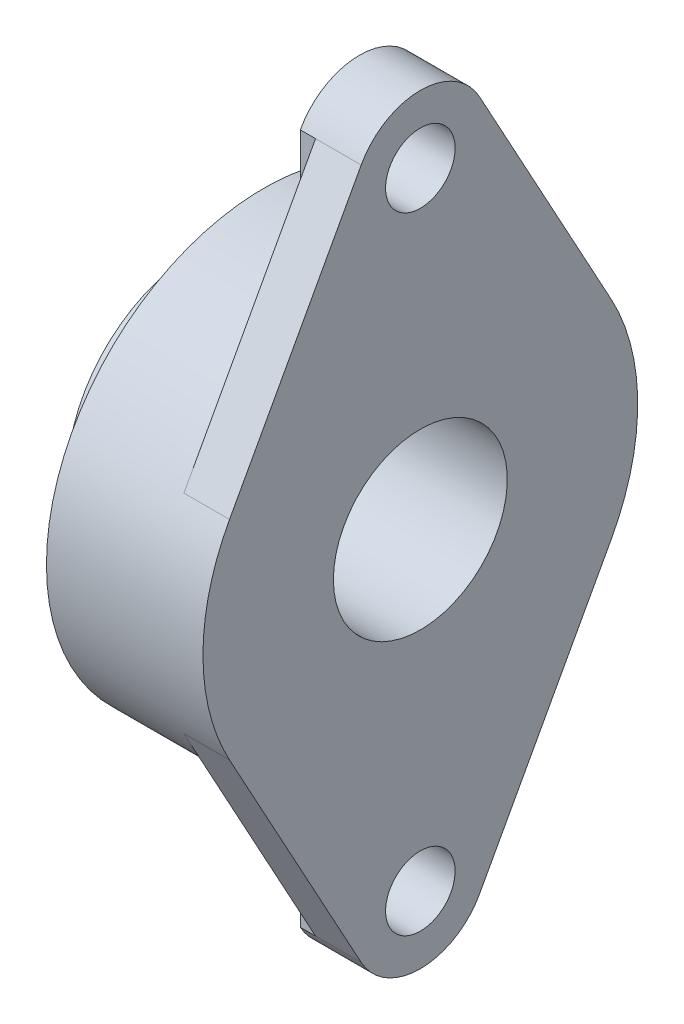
ISO-10303-21;
HEADER;
FILE_DESCRIPTION(('STEP AP214'),'2;1');
FILE_NAME('part.step','',(''),(''),'','','');
FILE_SCHEMA(('AUTOMOTIVE_DESIGN { 1 0 10303 214 1 1 1 1 }'));
ENDSEC;
DATA;
#1=APPLICATION_CONTEXT('core data for automotive mechanical design processes');
#2=APPLICATION_PROTOCOL_DEFINITION('international standard','automotive_design',2000,#1);
#3=PRODUCT_CONTEXT('',#1,'mechanical');
#4=PRODUCT('Part','Part','',(#3));
#5=PRODUCT_RELATED_PRODUCT_CATEGORY('part','',(#4));
#6=PRODUCT_DEFINITION_FORMATION('','',#4);
#7=PRODUCT_DEFINITION_CONTEXT('part definition',#1,'design');
#8=PRODUCT_DEFINITION('design','',#6,#7);
#9=PRODUCT_DEFINITION_SHAPE('','',#8);
#10=(LENGTH_UNIT() NAMED_UNIT(*) SI_UNIT(.MILLI.,.METRE.));
#11=(NAMED_UNIT(*) PLANE_ANGLE_UNIT() SI_UNIT($,.RADIAN.));
#12=(NAMED_UNIT(*) SI_UNIT($,.STERADIAN.) SOLID_ANGLE_UNIT());
#13=UNCERTAINTY_MEASURE_WITH_UNIT(LENGTH_MEASURE(1.E-05),#10,'distance_accuracy_value','');
#14=(GEOMETRIC_REPRESENTATION_CONTEXT(3) GLOBAL_UNCERTAINTY_ASSIGNED_CONTEXT((#13)) GLOBAL_UNIT_ASSIGNED_CONTEXT((#10,
#11,#12)) REPRESENTATION_CONTEXT('',''));
#15=CARTESIAN_POINT('',(0.,0.,0.));
#16=DIRECTION('',(0.,0.,1.));
#17=DIRECTION('',(1.,0.,0.));
#18=AXIS2_PLACEMENT_3D('',#15,#16,#17);
#19=CARTESIAN_POINT('',(-10.5,-79.759870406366,-43.8861967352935));
#20=DIRECTION('',(-1.,0.,0.));
#21=DIRECTION('',(0.,0.,1.));
#22=AXIS2_PLACEMENT_3D('',#19,#20,#21);
#23=PLANE('',#22);
#24=DIRECTION('',(0.,-1.,0.));
#25=VECTOR('',#24,1.);
#26=CARTESIAN_POINT('',(-10.5,-63.7703056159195,-13.604720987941));
#27=LINE('',#26,#25);
#28=CARTESIAN_POINT('',(-10.5,-48.1135278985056,-13.604720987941));
#29=VERTEX_POINT('',#28);
#30=CARTESIAN_POINT('',(-10.5,-79.4270833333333,-13.604720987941));
#31=VERTEX_POINT('',#30);
#32=EDGE_CURVE('E71',#29,#31,#27,.T.);
#33=ORIENTED_EDGE('',*,*,#32,.F.);
#34=CARTESIAN_POINT('',(-10.5,0.,0.));
#35=DIRECTION('',(-1.,0.,0.));
#36=DIRECTION('',(0.,0.,1.));
#37=AXIS2_PLACEMENT_3D('',#34,#35,#36);
#38=CIRCLE('',#37,50.);
#39=CARTESIAN_POINT('',(-10.5,-23.962571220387,-43.8838830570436));
#40=VERTEX_POINT('',#39);
#41=EDGE_CURVE('E208',#40,#29,#38,.T.);
#42=ORIENTED_EDGE('',*,*,#41,.F.);
#43=DIRECTION('',(0.,0.877723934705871,-0.479166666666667));
#44=VECTOR('',#43,1.);
#45=CARTESIAN_POINT('',(-10.5,-51.6927083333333,-28.7454588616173));
#46=LINE('',#45,#44);
#47=EDGE_CURVE('E308',#31,#40,#46,.T.);
#48=ORIENTED_EDGE('',*,*,#47,.F.);
#49=EDGE_LOOP('',(#33,#42,#48));
#50=FACE_BOUND('',#49,.T.);
#51=ADVANCED_FACE('F16',(#50),#23,.T.);
#52=CARTESIAN_POINT('',(-14.,-79.4270833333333,-13.604720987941));
#53=DIRECTION('',(0.,0.,-1.));
#54=DIRECTION('',(0.,1.,0.));
#55=AXIS2_PLACEMENT_3D('',#52,#53,#54);
#56=PLANE('',#55);
#57=DIRECTION('',(0.,-1.,0.));
#58=VECTOR('',#57,1.);
#59=CARTESIAN_POINT('',(-14.,-68.0036963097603,-13.604720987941));
#60=LINE('',#59,#58);
#61=CARTESIAN_POINT('',(-14.,-48.1135278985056,-13.604720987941));
#62=VERTEX_POINT('',#61);
#63=CARTESIAN_POINT('',(-14.,-79.4270833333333,-13.604720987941));
#64=VERTEX_POINT('',#63);
#65=EDGE_CURVE('E65',#62,#64,#60,.T.);
#66=ORIENTED_EDGE('',*,*,#65,.F.);
#67=DIRECTION('',(-1.,0.,0.));
#68=VECTOR('',#67,1.);
#69=CARTESIAN_POINT('',(-18.,-48.1135278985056,-13.604720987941));
#70=LINE('',#69,#68);
#71=EDGE_CURVE('E300',#29,#62,#70,.T.);
#72=ORIENTED_EDGE('',*,*,#71,.F.);
#73=ORIENTED_EDGE('',*,*,#32,.T.);
#74=DIRECTION('',(1.,0.,0.));
#75=VECTOR('',#74,1.);
#76=CARTESIAN_POINT('',(-7.,-79.4270833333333,-13.604720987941));
#77=LINE('',#76,#75);
#78=EDGE_CURVE('E316',#64,#31,#77,.T.);
#79=ORIENTED_EDGE('',*,*,#78,.F.);
#80=EDGE_LOOP('',(#66,#72,#73,#79));
#81=FACE_BOUND('',#80,.T.);
#82=ADVANCED_FACE('F482',(#81),#56,.T.);
#83=CARTESIAN_POINT('',(-10.5,23.6297840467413,-43.8861967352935));
#84=DIRECTION('',(-1.,0.,0.));
#85=DIRECTION('',(0.,0.,1.));
#86=AXIS2_PLACEMENT_3D('',#83,#84,#85);
#87=PLANE('',#86);
#88=CARTESIAN_POINT('',(-10.5,0.,0.));
#89=DIRECTION('',(-1.,0.,0.));
#90=DIRECTION('',(0.,0.,1.));
#91=AXIS2_PLACEMENT_3D('',#88,#89,#90);
#92=CIRCLE('',#91,50.);
#93=CARTESIAN_POINT('',(-10.5,48.1135278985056,-13.604720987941));
#94=VERTEX_POINT('',#93);
#95=CARTESIAN_POINT('',(-10.5,23.9625711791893,-43.8838830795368));
#96=VERTEX_POINT('',#95);
#97=EDGE_CURVE('E360',#94,#96,#92,.T.);
#98=ORIENTED_EDGE('',*,*,#97,.F.);
#99=DIRECTION('',(0.,-1.,0.));
#100=VECTOR('',#99,1.);
#101=CARTESIAN_POINT('',(-10.5,63.7703056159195,-13.604720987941));
#102=LINE('',#101,#100);
#103=CARTESIAN_POINT('',(-10.5,79.4270833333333,-13.604720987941));
#104=VERTEX_POINT('',#103);
#105=EDGE_CURVE('E270',#104,#94,#102,.T.);
#106=ORIENTED_EDGE('',*,*,#105,.F.);
#107=DIRECTION('',(0.,0.87772393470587,0.479166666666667));
#108=VECTOR('',#107,1.);
#109=CARTESIAN_POINT('',(-10.5,51.6927083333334,-28.7454588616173));
#110=LINE('',#109,#108);
#111=EDGE_CURVE('E203',#96,#104,#110,.T.);
#112=ORIENTED_EDGE('',*,*,#111,.F.);
#113=EDGE_LOOP('',(#98,#106,#112));
#114=FACE_BOUND('',#113,.T.);
#115=ADVANCED_FACE('F371',(#114),#87,.T.);
#116=CARTESIAN_POINT('',(-14.,48.1135278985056,-13.604720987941));
#117=DIRECTION('',(0.,0.,-1.));
#118=DIRECTION('',(0.,1.,0.));
#119=AXIS2_PLACEMENT_3D('',#116,#117,#118);
#120=PLANE('',#119);
#121=DIRECTION('',(0.,-1.,0.));
#122=VECTOR('',#121,1.);
#123=CARTESIAN_POINT('',(-14.,68.0036963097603,-13.604720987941));
#124=LINE('',#123,#122);
#125=CARTESIAN_POINT('',(-14.,79.4270833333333,-13.604720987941));
#126=VERTEX_POINT('',#125);
#127=CARTESIAN_POINT('',(-14.,48.1135278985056,-13.604720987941));
#128=VERTEX_POINT('',#127);
#129=EDGE_CURVE('E245',#126,#128,#124,.T.);
#130=ORIENTED_EDGE('',*,*,#129,.F.);
#131=DIRECTION('',(-1.,0.,0.));
#132=VECTOR('',#131,1.);
#133=CARTESIAN_POINT('',(-7.,79.4270833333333,-13.604720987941));
#134=LINE('',#133,#132);
#135=EDGE_CURVE('E197',#104,#126,#134,.T.);
#136=ORIENTED_EDGE('',*,*,#135,.F.);
#137=ORIENTED_EDGE('',*,*,#105,.T.);
#138=DIRECTION('',(1.,0.,0.));
#139=VECTOR('',#138,1.);
#140=CARTESIAN_POINT('',(-18.,48.1135278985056,-13.604720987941));
#141=LINE('',#140,#139);
#142=EDGE_CURVE('E215',#128,#94,#141,.T.);
#143=ORIENTED_EDGE('',*,*,#142,.F.);
#144=EDGE_LOOP('',(#130,#136,#137,#143));
#145=FACE_BOUND('',#144,.T.);
#146=ADVANCED_FACE('F366',(#145),#120,.T.);
#147=CARTESIAN_POINT('',(-14.,-48.1135278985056,13.604720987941));
#148=DIRECTION('',(0.,0.,1.));
#149=DIRECTION('',(0.,-1.,0.));
#150=AXIS2_PLACEMENT_3D('',#147,#148,#149);
#151=PLANE('',#150);
#152=DIRECTION('',(0.,1.,0.));
#153=VECTOR('',#152,1.);
#154=CARTESIAN_POINT('',(-14.,-68.0036963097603,13.604720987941));
#155=LINE('',#154,#153);
#156=CARTESIAN_POINT('',(-14.,-79.4270833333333,13.604720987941));
#157=VERTEX_POINT('',#156);
#158=CARTESIAN_POINT('',(-14.,-48.1135278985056,13.604720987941));
#159=VERTEX_POINT('',#158);
#160=EDGE_CURVE('E59',#157,#159,#155,.T.);
#161=ORIENTED_EDGE('',*,*,#160,.F.);
#162=DIRECTION('',(-1.,0.,0.));
#163=VECTOR('',#162,1.);
#164=CARTESIAN_POINT('',(-7.,-79.4270833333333,13.604720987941));
#165=LINE('',#164,#163);
#166=CARTESIAN_POINT('',(-10.5,-79.4270833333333,13.604720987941));
#167=VERTEX_POINT('',#166);
#168=EDGE_CURVE('E257',#167,#157,#165,.T.);
#169=ORIENTED_EDGE('',*,*,#168,.F.);
#170=DIRECTION('',(0.,1.,0.));
#171=VECTOR('',#170,1.);
#172=CARTESIAN_POINT('',(-10.5,-79.4270833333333,13.604720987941));
#173=LINE('',#172,#171);
#174=CARTESIAN_POINT('',(-10.5,-48.1135278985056,13.604720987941));
#175=VERTEX_POINT('',#174);
#176=EDGE_CURVE('E251',#175,#167,#173,.F.);
#177=ORIENTED_EDGE('',*,*,#176,.F.);
#178=DIRECTION('',(1.,0.,0.));
#179=VECTOR('',#178,1.);
#180=CARTESIAN_POINT('',(-18.,-48.1135278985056,13.604720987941));
#181=LINE('',#180,#179);
#182=EDGE_CURVE('E277',#159,#175,#181,.T.);
#183=ORIENTED_EDGE('',*,*,#182,.F.);
#184=EDGE_LOOP('',(#161,#169,#177,#183));
#185=FACE_BOUND('',#184,.T.);
#186=ADVANCED_FACE('F432',(#185),#151,.T.);
#187=CARTESIAN_POINT('',(-10.5,23.6297840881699,13.604720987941));
#188=DIRECTION('',(-1.,0.,0.));
#189=DIRECTION('',(0.,0.,1.));
#190=AXIS2_PLACEMENT_3D('',#187,#188,#189);
#191=PLANE('',#190);
#192=DIRECTION('',(0.,1.,0.));
#193=VECTOR('',#192,1.);
#194=CARTESIAN_POINT('',(-10.5,63.7703056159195,13.604720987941));
#195=LINE('',#194,#193);
#196=CARTESIAN_POINT('',(-10.5,48.1135278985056,13.604720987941));
#197=VERTEX_POINT('',#196);
#198=CARTESIAN_POINT('',(-10.5,79.4270833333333,13.604720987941));
#199=VERTEX_POINT('',#198);
#200=EDGE_CURVE('E133',#197,#199,#195,.T.);
#201=ORIENTED_EDGE('',*,*,#200,.F.);
#202=CARTESIAN_POINT('',(-10.5,0.,0.));
#203=DIRECTION('',(-1.,0.,0.));
#204=DIRECTION('',(0.,0.,1.));
#205=AXIS2_PLACEMENT_3D('',#202,#203,#204);
#206=CIRCLE('',#205,50.);
#207=CARTESIAN_POINT('',(-10.5,23.9625712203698,43.883883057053));
#208=VERTEX_POINT('',#207);
#209=EDGE_CURVE('E184',#208,#197,#206,.T.);
#210=ORIENTED_EDGE('',*,*,#209,.F.);
#211=DIRECTION('',(0.,-0.877723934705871,0.479166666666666));
#212=VECTOR('',#211,1.);
#213=CARTESIAN_POINT('',(-10.5,51.6927083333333,28.7454588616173));
#214=LINE('',#213,#212);
#215=EDGE_CURVE('E274',#199,#208,#214,.T.);
#216=ORIENTED_EDGE('',*,*,#215,.F.);
#217=EDGE_LOOP('',(#201,#210,#216));
#218=FACE_BOUND('',#217,.T.);
#219=ADVANCED_FACE('F420',(#218),#191,.T.);
#220=CARTESIAN_POINT('',(-14.,79.4270833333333,13.604720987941));
#221=DIRECTION('',(0.,0.,1.));
#222=DIRECTION('',(0.,-1.,0.));
#223=AXIS2_PLACEMENT_3D('',#220,#221,#222);
#224=PLANE('',#223);
#225=DIRECTION('',(0.,1.,0.));
#226=VECTOR('',#225,1.);
#227=CARTESIAN_POINT('',(-14.,68.0036963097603,13.604720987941));
#228=LINE('',#227,#226);
#229=CARTESIAN_POINT('',(-14.,48.1135278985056,13.604720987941));
#230=VERTEX_POINT('',#229);
#231=CARTESIAN_POINT('',(-14.,79.4270833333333,13.604720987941));
#232=VERTEX_POINT('',#231);
#233=EDGE_CURVE('E128',#230,#232,#228,.T.);
#234=ORIENTED_EDGE('',*,*,#233,.F.);
#235=DIRECTION('',(-1.,0.,0.));
#236=VECTOR('',#235,1.);
#237=CARTESIAN_POINT('',(-18.,48.1135278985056,13.604720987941));
#238=LINE('',#237,#236);
#239=EDGE_CURVE('E267',#197,#230,#238,.T.);
#240=ORIENTED_EDGE('',*,*,#239,.F.);
#241=ORIENTED_EDGE('',*,*,#200,.T.);
#242=DIRECTION('',(1.,0.,0.));
#243=VECTOR('',#242,1.);
#244=CARTESIAN_POINT('',(-7.,79.4270833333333,13.604720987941));
#245=LINE('',#244,#243);
#246=EDGE_CURVE('E284',#232,#199,#245,.T.);
#247=ORIENTED_EDGE('',*,*,#246,.F.);
#248=EDGE_LOOP('',(#234,#240,#241,#247));
#249=FACE_BOUND('',#248,.T.);
#250=ADVANCED_FACE('F424',(#249),#224,.T.);
#251=CARTESIAN_POINT('',(-10.5,-79.7598704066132,13.604720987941));
#252=DIRECTION('',(-1.,0.,0.));
#253=DIRECTION('',(0.,0.,1.));
#254=AXIS2_PLACEMENT_3D('',#251,#252,#253);
#255=PLANE('',#254);
#256=CARTESIAN_POINT('',(-10.5,0.,0.));
#257=DIRECTION('',(-1.,0.,0.));
#258=DIRECTION('',(0.,0.,1.));
#259=AXIS2_PLACEMENT_3D('',#256,#257,#258);
#260=CIRCLE('',#259,50.);
#261=CARTESIAN_POINT('',(-10.5,-23.9625711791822,43.8838830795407));
#262=VERTEX_POINT('',#261);
#263=EDGE_CURVE('E154',#175,#262,#260,.T.);
#264=ORIENTED_EDGE('',*,*,#263,.F.);
#265=ORIENTED_EDGE('',*,*,#176,.T.);
#266=DIRECTION('',(0.,-0.877723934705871,-0.479166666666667));
#267=VECTOR('',#266,1.);
#268=CARTESIAN_POINT('',(-10.5,-51.6927083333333,28.7454588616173));
#269=LINE('',#268,#267);
#270=EDGE_CURVE('E171',#262,#167,#269,.T.);
#271=ORIENTED_EDGE('',*,*,#270,.F.);
#272=EDGE_LOOP('',(#264,#265,#271));
#273=FACE_BOUND('',#272,.T.);
#274=ADVANCED_FACE('F238',(#273),#255,.T.);
#275=CARTESIAN_POINT('',(-14.,48.1135278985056,13.604720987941));
#276=CARTESIAN_POINT('',(-14.,87.5,13.604720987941));
#277=CARTESIAN_POINT('',(-14.,87.893864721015,13.604720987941));
#278=B_SPLINE_CURVE_WITH_KNOTS('',1,(#275,#276,#277),.UNSPECIFIED.,.F.,.F.,(2,1,2),(0.,1.,1.01),.UNSPECIFIED.);
#279=DIRECTION('',(0.,0.,-1.));
#280=VECTOR('',#279,1.);
#281=SURFACE_OF_LINEAR_EXTRUSION('',#278,#280);
#282=CARTESIAN_POINT('',(-14.,72.,0.));
#283=DIRECTION('',(1.,0.,0.));
#284=DIRECTION('',(0.,0.,-1.));
#285=AXIS2_PLACEMENT_3D('',#282,#283,#284);
#286=CIRCLE('',#285,7.99999999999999);
#287=CARTESIAN_POINT('',(-14.,72.,-7.99999999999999));
#288=VERTEX_POINT('',#287);
#289=EDGE_CURVE('E165',#288,#288,#286,.F.);
#290=ORIENTED_EDGE('',*,*,#289,.F.);
#291=EDGE_LOOP('',(#290));
#292=FACE_BOUND('',#291,.T.);
#293=ORIENTED_EDGE('',*,*,#129,.T.);
#294=CARTESIAN_POINT('',(-14.,0.,0.));
#295=DIRECTION('',(-1.,0.,0.));
#296=DIRECTION('',(0.,0.,1.));
#297=AXIS2_PLACEMENT_3D('',#294,#295,#296);
#298=CIRCLE('',#297,50.);
#299=EDGE_CURVE('E261',#230,#128,#298,.T.);
#300=ORIENTED_EDGE('',*,*,#299,.F.);
#301=ORIENTED_EDGE('',*,*,#233,.T.);
#302=CARTESIAN_POINT('',(-14.,72.,0.));
#303=DIRECTION('',(1.,0.,0.));
#304=DIRECTION('',(0.,0.,-1.));
#305=AXIS2_PLACEMENT_3D('',#302,#303,#304);
#306=CIRCLE('',#305,15.5);
#307=EDGE_CURVE('E288',#126,#232,#306,.T.);
#308=ORIENTED_EDGE('',*,*,#307,.F.);
#309=EDGE_LOOP('',(#293,#300,#301,#308));
#310=FACE_BOUND('',#309,.T.);
#311=ADVANCED_FACE('F232',(#292,#310),#281,.T.);
#312=CARTESIAN_POINT('',(-14.,-87.893864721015,13.604720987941));
#313=CARTESIAN_POINT('',(-14.,-87.5,13.604720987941));
#314=CARTESIAN_POINT('',(-14.,-48.1135278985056,13.604720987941));
#315=B_SPLINE_CURVE_WITH_KNOTS('',1,(#312,#313,#314),.UNSPECIFIED.,.F.,.F.,(2,1,2),(-0.01,0.,
1.),.UNSPECIFIED.);
#316=DIRECTION('',(0.,0.,-1.));
#317=VECTOR('',#316,1.);
#318=SURFACE_OF_LINEAR_EXTRUSION('',#315,#317);
#319=CARTESIAN_POINT('',(-14.,-72.,0.));
#320=DIRECTION('',(1.,0.,0.));
#321=DIRECTION('',(0.,0.,-1.));
#322=AXIS2_PLACEMENT_3D('',#319,#320,#321);
#323=CIRCLE('',#322,8.00000000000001);
#324=CARTESIAN_POINT('',(-14.,-72.,-8.00000000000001));
#325=VERTEX_POINT('',#324);
#326=EDGE_CURVE('E169',#325,#325,#323,.F.);
#327=ORIENTED_EDGE('',*,*,#326,.F.);
#328=EDGE_LOOP('',(#327));
#329=FACE_BOUND('',#328,.T.);
#330=ORIENTED_EDGE('',*,*,#65,.T.);
#331=CARTESIAN_POINT('',(-14.,-72.,0.));
#332=DIRECTION('',(1.,0.,0.));
#333=DIRECTION('',(0.,0.,-1.));
#334=AXIS2_PLACEMENT_3D('',#331,#332,#333);
#335=CIRCLE('',#334,15.5);
#336=EDGE_CURVE('E19',#157,#64,#335,.T.);
#337=ORIENTED_EDGE('',*,*,#336,.F.);
#338=ORIENTED_EDGE('',*,*,#160,.T.);
#339=CARTESIAN_POINT('',(-14.,0.,0.));
#340=DIRECTION('',(-1.,0.,0.));
#341=DIRECTION('',(0.,0.,1.));
#342=AXIS2_PLACEMENT_3D('',#339,#340,#341);
#343=CIRCLE('',#342,50.);
#344=EDGE_CURVE('E353',#62,#159,#343,.T.);
#345=ORIENTED_EDGE('',*,*,#344,.F.);
#346=EDGE_LOOP('',(#330,#337,#338,#345));
#347=FACE_BOUND('',#346,.T.);
#348=ADVANCED_FACE('F227',(#329,#347),#318,.T.);
#349=CARTESIAN_POINT('',(-36.,-50.,50.6000021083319));
#350=DIRECTION('',(-1.,0.,0.));
#351=DIRECTION('',(0.,1.,0.));
#352=AXIS2_PLACEMENT_3D('',#349,#350,#351);
#353=PLANE('',#352);
#354=CARTESIAN_POINT('',(-36.,0.,0.));
#355=DIRECTION('',(-1.,0.,0.));
#356=DIRECTION('',(0.,0.,1.));
#357=AXIS2_PLACEMENT_3D('',#354,#355,#356);
#358=CIRCLE('',#357,30.);
#359=CARTESIAN_POINT('',(-36.,0.,30.));
#360=VERTEX_POINT('',#359);
#361=EDGE_CURVE('E344',#360,#360,#358,.T.);
#362=ORIENTED_EDGE('',*,*,#361,.F.);
#363=EDGE_LOOP('',(#362));
#364=FACE_BOUND('',#363,.T.);
#365=CARTESIAN_POINT('',(-36.,0.,0.));
#366=DIRECTION('',(-1.,0.,0.));
#367=DIRECTION('',(0.,0.,1.));
#368=AXIS2_PLACEMENT_3D('',#365,#366,#367);
#369=CIRCLE('',#368,50.);
#370=CARTESIAN_POINT('',(-36.,0.,50.));
#371=VERTEX_POINT('',#370);
#372=EDGE_CURVE('E190',#371,#371,#369,.F.);
#373=ORIENTED_EDGE('',*,*,#372,.F.);
#374=EDGE_LOOP('',(#373));
#375=FACE_BOUND('',#374,.T.);
#376=ADVANCED_FACE('F231',(#364,#375),#353,.T.);
#377=CARTESIAN_POINT('',(0.,-72.,0.));
#378=DIRECTION('',(1.,0.,0.));
#379=DIRECTION('',(0.,0.,-1.));
#380=AXIS2_PLACEMENT_3D('',#377,#378,#379);
#381=CYLINDRICAL_SURFACE('',#380,15.5);
#382=ORIENTED_EDGE('',*,*,#336,.T.);
#383=ORIENTED_EDGE('',*,*,#78,.T.);
#384=DIRECTION('',(1.,0.,0.));
#385=VECTOR('',#384,1.);
#386=CARTESIAN_POINT('',(-10.5,-79.4270833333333,-13.604720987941));
#387=LINE('',#386,#385);
#388=CARTESIAN_POINT('',(0.,-79.4270833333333,-13.604720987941));
#389=VERTEX_POINT('',#388);
#390=EDGE_CURVE('E212',#389,#31,#387,.F.);
#391=ORIENTED_EDGE('',*,*,#390,.F.);
#392=CARTESIAN_POINT('',(0.,-72.,0.));
#393=DIRECTION('',(1.,0.,0.));
#394=DIRECTION('',(0.,0.,-1.));
#395=AXIS2_PLACEMENT_3D('',#392,#393,#394);
#396=CIRCLE('',#395,15.5);
#397=CARTESIAN_POINT('',(0.,-79.4270833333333,13.604720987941));
#398=VERTEX_POINT('',#397);
#399=EDGE_CURVE('E341',#398,#389,#396,.T.);
#400=ORIENTED_EDGE('',*,*,#399,.F.);
#401=DIRECTION('',(1.,0.,0.));
#402=VECTOR('',#401,1.);
#403=CARTESIAN_POINT('',(-10.5,-79.4270833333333,13.604720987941));
#404=LINE('',#403,#402);
#405=EDGE_CURVE('E166',#167,#398,#404,.T.);
#406=ORIENTED_EDGE('',*,*,#405,.F.);
#407=ORIENTED_EDGE('',*,*,#168,.T.);
#408=EDGE_LOOP('',(#382,#383,#391,#400,#406,#407));
#409=FACE_BOUND('',#408,.T.);
#410=ADVANCED_FACE('F454',(#409),#381,.T.);
#411=CARTESIAN_POINT('',(-10.5,-79.4270833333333,-13.604720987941));
#412=DIRECTION('',(0.,-0.479166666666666,-0.877723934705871));
#413=DIRECTION('',(0.,0.877723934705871,-0.479166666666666));
#414=AXIS2_PLACEMENT_3D('',#411,#412,#413);
#415=PLANE('',#414);
#416=CARTESIAN_POINT('',(0.,-79.4270833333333,-13.604720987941));
#417=CARTESIAN_POINT('',(0.,-77.1158854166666,-14.8664491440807));
#418=CARTESIAN_POINT('',(0.,-74.8046875,-16.1281773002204));
#419=CARTESIAN_POINT('',(0.,-70.1822916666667,-18.6516336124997));
#420=CARTESIAN_POINT('',(0.,-67.87109375,-19.9133617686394));
#421=CARTESIAN_POINT('',(0.,-63.2486979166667,-22.4368180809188));
#422=CARTESIAN_POINT('',(0.,-60.9375,-23.6985462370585));
#423=CARTESIAN_POINT('',(0.,-56.3151041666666,-26.2220025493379));
#424=CARTESIAN_POINT('',(0.,-54.00390625,-27.4837307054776));
#425=CARTESIAN_POINT('',(0.,-49.3815104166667,-30.0071870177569));
#426=CARTESIAN_POINT('',(0.,-47.0703125,-31.2689151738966));
#427=CARTESIAN_POINT('',(0.,-42.4479166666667,-33.792371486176));
#428=CARTESIAN_POINT('',(0.,-40.13671875,-35.0540996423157));
#429=CARTESIAN_POINT('',(0.,-35.5143229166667,-37.5775559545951));
#430=CARTESIAN_POINT('',(0.,-33.203125,-38.8392841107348));
#431=CARTESIAN_POINT('',(0.,-28.5807291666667,-41.3627404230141));
#432=CARTESIAN_POINT('',(0.,-26.26953125,-42.6244685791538));
#433=CARTESIAN_POINT('',(0.,-23.9583333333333,-43.8861967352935));
#434=B_SPLINE_CURVE_WITH_KNOTS('',3,(#416,#417,#418,#419,#420,#421,#422,#423,#424,#425,#426,
#427,#428,#429,#430,#431,#432,#433),.UNSPECIFIED.,.F.,.F.,(4,2,2,2,2,2,2,2,4),(0.,
7.89951541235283,15.7990308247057,23.6985462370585,31.5980616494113,39.4975770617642,
47.397092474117,55.2966078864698,63.1961232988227),.UNSPECIFIED.);
#435=CARTESIAN_POINT('',(0.,-23.9583333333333,-43.8861967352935));
#436=VERTEX_POINT('',#435);
#437=EDGE_CURVE('E340',#389,#436,#434,.T.);
#438=ORIENTED_EDGE('',*,*,#437,.F.);
#439=ORIENTED_EDGE('',*,*,#390,.T.);
#440=ORIENTED_EDGE('',*,*,#47,.T.);
#441=CARTESIAN_POINT('',(-10.5,-23.9583333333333,-43.8861967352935));
#442=VERTEX_POINT('',#441);
#443=EDGE_CURVE('E34',#40,#442,#46,.T.);
#444=ORIENTED_EDGE('',*,*,#443,.T.);
#445=DIRECTION('',(-1.,0.,0.));
#446=VECTOR('',#445,1.);
#447=CARTESIAN_POINT('',(-18.,-23.9583333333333,-43.8861967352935));
#448=LINE('',#447,#446);
#449=EDGE_CURVE('E206',#436,#442,#448,.T.);
#450=ORIENTED_EDGE('',*,*,#449,.F.);
#451=EDGE_LOOP('',(#438,#439,#440,#444,#450));
#452=FACE_BOUND('',#451,.T.);
#453=ADVANCED_FACE('F472',(#452),#415,.T.);
#454=CARTESIAN_POINT('',(-10.5,23.9583333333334,-43.8861967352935));
#455=DIRECTION('',(0.,0.479166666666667,-0.87772393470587));
#456=DIRECTION('',(0.,0.87772393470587,0.479166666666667));
#457=AXIS2_PLACEMENT_3D('',#454,#455,#456);
#458=PLANE('',#457);
#459=CARTESIAN_POINT('',(0.,23.9583333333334,-43.8861967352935));
#460=CARTESIAN_POINT('',(0.,26.26953125,-42.6244685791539));
#461=CARTESIAN_POINT('',(0.,28.5807291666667,-41.3627404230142));
#462=CARTESIAN_POINT('',(0.,33.203125,-38.8392841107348));
#463=CARTESIAN_POINT('',(0.,35.5143229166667,-37.5775559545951));
#464=CARTESIAN_POINT('',(0.,40.13671875,-35.0540996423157));
#465=CARTESIAN_POINT('',(0.,42.4479166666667,-33.792371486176));
#466=CARTESIAN_POINT('',(0.,47.0703125,-31.2689151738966));
#467=CARTESIAN_POINT('',(0.,49.3815104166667,-30.0071870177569));
#468=CARTESIAN_POINT('',(0.,54.00390625,-27.4837307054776));
#469=CARTESIAN_POINT('',(0.,56.3151041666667,-26.2220025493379));
#470=CARTESIAN_POINT('',(0.,60.9375,-23.6985462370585));
#471=CARTESIAN_POINT('',(0.,63.2486979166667,-22.4368180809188));
#472=CARTESIAN_POINT('',(0.,67.87109375,-19.9133617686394));
#473=CARTESIAN_POINT('',(0.,70.1822916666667,-18.6516336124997));
#474=CARTESIAN_POINT('',(0.,74.8046875,-16.1281773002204));
#475=CARTESIAN_POINT('',(0.,77.1158854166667,-14.8664491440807));
#476=CARTESIAN_POINT('',(0.,79.4270833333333,-13.604720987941));
#477=B_SPLINE_CURVE_WITH_KNOTS('',3,(#459,#460,#461,#462,#463,#464,#465,#466,#467,#468,#469,
#470,#471,#472,#473,#474,#475,#476),.UNSPECIFIED.,.F.,.F.,(4,2,2,2,2,2,2,2,4),(0.,
7.89951541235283,15.7990308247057,23.6985462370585,31.5980616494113,39.4975770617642,
47.397092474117,55.2966078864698,63.1961232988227),.UNSPECIFIED.);
#478=CARTESIAN_POINT('',(0.,23.9583333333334,-43.8861967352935));
#479=VERTEX_POINT('',#478);
#480=CARTESIAN_POINT('',(0.,79.4270833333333,-13.604720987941));
#481=VERTEX_POINT('',#480);
#482=EDGE_CURVE('E336',#479,#481,#477,.T.);
#483=ORIENTED_EDGE('',*,*,#482,.F.);
#484=DIRECTION('',(1.,0.,0.));
#485=VECTOR('',#484,1.);
#486=CARTESIAN_POINT('',(-10.5,23.9583333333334,-43.8861967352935));
#487=LINE('',#486,#485);
#488=CARTESIAN_POINT('',(-10.5,23.9583333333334,-43.8861967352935));
#489=VERTEX_POINT('',#488);
#490=EDGE_CURVE('E198',#479,#489,#487,.F.);
#491=ORIENTED_EDGE('',*,*,#490,.T.);
#492=CARTESIAN_POINT('',(-10.5,0.,0.));
#493=DIRECTION('',(-1.,0.,0.));
#494=DIRECTION('',(0.,1.,0.));
#495=AXIS2_PLACEMENT_3D('',#492,#493,#494);
#496=CIRCLE('',#495,50.);
#497=EDGE_CURVE('E209',#96,#489,#496,.T.);
#498=ORIENTED_EDGE('',*,*,#497,.F.);
#499=ORIENTED_EDGE('',*,*,#111,.T.);
#500=DIRECTION('',(-1.,0.,0.));
#501=VECTOR('',#500,1.);
#502=CARTESIAN_POINT('',(-7.,79.4270833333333,-13.604720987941));
#503=LINE('',#502,#501);
#504=EDGE_CURVE('E194',#481,#104,#503,.T.);
#505=ORIENTED_EDGE('',*,*,#504,.F.);
#506=EDGE_LOOP('',(#483,#491,#498,#499,#505));
#507=FACE_BOUND('',#506,.T.);
#508=ADVANCED_FACE('F374',(#507),#458,.T.);
#509=CARTESIAN_POINT('',(0.,72.,0.));
#510=DIRECTION('',(1.,0.,0.));
#511=DIRECTION('',(0.,0.,-1.));
#512=AXIS2_PLACEMENT_3D('',#509,#510,#511);
#513=CYLINDRICAL_SURFACE('',#512,15.5);
#514=ORIENTED_EDGE('',*,*,#307,.T.);
#515=ORIENTED_EDGE('',*,*,#246,.T.);
#516=DIRECTION('',(1.,0.,0.));
#517=VECTOR('',#516,1.);
#518=CARTESIAN_POINT('',(-10.5,79.4270833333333,13.604720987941));
#519=LINE('',#518,#517);
#520=CARTESIAN_POINT('',(0.,79.4270833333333,13.604720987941));
#521=VERTEX_POINT('',#520);
#522=EDGE_CURVE('E187',#521,#199,#519,.F.);
#523=ORIENTED_EDGE('',*,*,#522,.F.);
#524=CARTESIAN_POINT('',(0.,72.,0.));
#525=DIRECTION('',(1.,0.,0.));
#526=DIRECTION('',(0.,0.,-1.));
#527=AXIS2_PLACEMENT_3D('',#524,#525,#526);
#528=CIRCLE('',#527,15.5);
#529=EDGE_CURVE('E333',#481,#521,#528,.T.);
#530=ORIENTED_EDGE('',*,*,#529,.F.);
#531=ORIENTED_EDGE('',*,*,#504,.T.);
#532=ORIENTED_EDGE('',*,*,#135,.T.);
#533=EDGE_LOOP('',(#514,#515,#523,#530,#531,#532));
#534=FACE_BOUND('',#533,.T.);
#535=ADVANCED_FACE('F423',(#534),#513,.T.);
#536=CARTESIAN_POINT('',(-10.5,79.4270833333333,13.604720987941));
#537=DIRECTION('',(0.,0.479166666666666,0.877723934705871));
#538=DIRECTION('',(0.,-0.877723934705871,0.479166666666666));
#539=AXIS2_PLACEMENT_3D('',#536,#537,#538);
#540=PLANE('',#539);
#541=CARTESIAN_POINT('',(0.,79.4270833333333,13.604720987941));
#542=CARTESIAN_POINT('',(0.,77.1158854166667,14.8664491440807));
#543=CARTESIAN_POINT('',(0.,74.8046875,16.1281773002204));
#544=CARTESIAN_POINT('',(0.,70.1822916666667,18.6516336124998));
#545=CARTESIAN_POINT('',(0.,67.87109375,19.9133617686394));
#546=CARTESIAN_POINT('',(0.,63.2486979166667,22.4368180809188));
#547=CARTESIAN_POINT('',(0.,60.9375,23.6985462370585));
#548=CARTESIAN_POINT('',(0.,56.3151041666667,26.2220025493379));
#549=CARTESIAN_POINT('',(0.,54.00390625,27.4837307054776));
#550=CARTESIAN_POINT('',(0.,49.3815104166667,30.0071870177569));
#551=CARTESIAN_POINT('',(0.,47.0703125,31.2689151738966));
#552=CARTESIAN_POINT('',(0.,42.4479166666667,33.792371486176));
#553=CARTESIAN_POINT('',(0.,40.13671875,35.0540996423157));
#554=CARTESIAN_POINT('',(0.,35.5143229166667,37.5775559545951));
#555=CARTESIAN_POINT('',(0.,33.203125,38.8392841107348));
#556=CARTESIAN_POINT('',(0.,28.5807291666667,41.3627404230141));
#557=CARTESIAN_POINT('',(0.,26.26953125,42.6244685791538));
#558=CARTESIAN_POINT('',(0.,23.9583333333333,43.8861967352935));
#559=B_SPLINE_CURVE_WITH_KNOTS('',3,(#541,#542,#543,#544,#545,#546,#547,#548,#549,#550,#551,
#552,#553,#554,#555,#556,#557,#558),.UNSPECIFIED.,.F.,.F.,(4,2,2,2,2,2,2,2,4),(0.,
7.89951541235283,15.7990308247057,23.6985462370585,31.5980616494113,39.4975770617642,
47.397092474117,55.2966078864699,63.1961232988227),.UNSPECIFIED.);
#560=CARTESIAN_POINT('',(0.,23.9583333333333,43.8861967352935));
#561=VERTEX_POINT('',#560);
#562=EDGE_CURVE('E332',#521,#561,#559,.T.);
#563=ORIENTED_EDGE('',*,*,#562,.F.);
#564=ORIENTED_EDGE('',*,*,#522,.T.);
#565=ORIENTED_EDGE('',*,*,#215,.T.);
#566=CARTESIAN_POINT('',(-10.5,23.9583333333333,43.8861967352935));
#567=VERTEX_POINT('',#566);
#568=EDGE_CURVE('E191',#208,#567,#214,.T.);
#569=ORIENTED_EDGE('',*,*,#568,.T.);
#570=DIRECTION('',(-1.,0.,0.));
#571=VECTOR('',#570,1.);
#572=CARTESIAN_POINT('',(-18.,23.9583333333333,43.8861967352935));
#573=LINE('',#572,#571);
#574=EDGE_CURVE('E158',#561,#567,#573,.T.);
#575=ORIENTED_EDGE('',*,*,#574,.F.);
#576=EDGE_LOOP('',(#563,#564,#565,#569,#575));
#577=FACE_BOUND('',#576,.T.);
#578=ADVANCED_FACE('F417',(#577),#540,.T.);
#579=CARTESIAN_POINT('',(-36.,0.,0.));
#580=DIRECTION('',(-1.,0.,0.));
#581=DIRECTION('',(0.,0.,1.));
#582=AXIS2_PLACEMENT_3D('',#579,#580,#581);
#583=CYLINDRICAL_SURFACE('',#582,50.);
#584=ORIENTED_EDGE('',*,*,#372,.T.);
#585=EDGE_LOOP('',(#584));
#586=FACE_BOUND('',#585,.T.);
#587=ORIENTED_EDGE('',*,*,#239,.T.);
#588=ORIENTED_EDGE('',*,*,#299,.T.);
#589=ORIENTED_EDGE('',*,*,#142,.T.);
#590=ORIENTED_EDGE('',*,*,#97,.T.);
#591=ORIENTED_EDGE('',*,*,#497,.T.);
#592=ORIENTED_EDGE('',*,*,#490,.F.);
#593=CARTESIAN_POINT('',(0.,0.,0.));
#594=DIRECTION('',(-1.,0.,0.));
#595=DIRECTION('',(0.,0.,1.));
#596=AXIS2_PLACEMENT_3D('',#593,#594,#595);
#597=CIRCLE('',#596,50.);
#598=EDGE_CURVE('E337',#436,#479,#597,.F.);
#599=ORIENTED_EDGE('',*,*,#598,.F.);
#600=ORIENTED_EDGE('',*,*,#449,.T.);
#601=ORIENTED_EDGE('',*,*,#443,.F.);
#602=ORIENTED_EDGE('',*,*,#41,.T.);
#603=ORIENTED_EDGE('',*,*,#71,.T.);
#604=ORIENTED_EDGE('',*,*,#344,.T.);
#605=ORIENTED_EDGE('',*,*,#182,.T.);
#606=ORIENTED_EDGE('',*,*,#263,.T.);
#607=CARTESIAN_POINT('',(-10.5,0.,0.));
#608=DIRECTION('',(-1.,0.,0.));
#609=DIRECTION('',(0.,1.,0.));
#610=AXIS2_PLACEMENT_3D('',#607,#608,#609);
#611=CIRCLE('',#610,50.);
#612=CARTESIAN_POINT('',(-10.5,-23.9583333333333,43.8861967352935));
#613=VERTEX_POINT('',#612);
#614=EDGE_CURVE('E145',#262,#613,#611,.T.);
#615=ORIENTED_EDGE('',*,*,#614,.T.);
#616=DIRECTION('',(1.,0.,0.));
#617=VECTOR('',#616,1.);
#618=CARTESIAN_POINT('',(-10.5,-23.9583333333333,43.8861967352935));
#619=LINE('',#618,#617);
#620=CARTESIAN_POINT('',(0.,-23.9583333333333,43.8861967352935));
#621=VERTEX_POINT('',#620);
#622=EDGE_CURVE('E150',#621,#613,#619,.F.);
#623=ORIENTED_EDGE('',*,*,#622,.F.);
#624=CARTESIAN_POINT('',(0.,0.,0.));
#625=DIRECTION('',(-1.,0.,0.));
#626=DIRECTION('',(0.,0.,1.));
#627=AXIS2_PLACEMENT_3D('',#624,#625,#626);
#628=CIRCLE('',#627,50.);
#629=EDGE_CURVE('E330',#561,#621,#628,.F.);
#630=ORIENTED_EDGE('',*,*,#629,.F.);
#631=ORIENTED_EDGE('',*,*,#574,.T.);
#632=ORIENTED_EDGE('',*,*,#568,.F.);
#633=ORIENTED_EDGE('',*,*,#209,.T.);
#634=EDGE_LOOP('',(#587,#588,#589,#590,#591,#592,#599,#600,#601,#602,#603,#604,#605,#606,#615,
#623,#630,#631,#632,#633));
#635=FACE_BOUND('',#634,.T.);
#636=ADVANCED_FACE('F148',(#586,#635),#583,.T.);
#637=CARTESIAN_POINT('',(-10.5,-23.9583333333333,43.8861967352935));
#638=DIRECTION('',(0.,-0.479166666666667,0.877723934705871));
#639=DIRECTION('',(0.,-0.877723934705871,-0.479166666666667));
#640=AXIS2_PLACEMENT_3D('',#637,#638,#639);
#641=PLANE('',#640);
#642=CARTESIAN_POINT('',(0.,-23.9583333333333,43.8861967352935));
#643=CARTESIAN_POINT('',(0.,-26.26953125,42.6244685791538));
#644=CARTESIAN_POINT('',(0.,-28.5807291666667,41.3627404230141));
#645=CARTESIAN_POINT('',(0.,-33.203125,38.8392841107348));
#646=CARTESIAN_POINT('',(0.,-35.5143229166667,37.5775559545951));
#647=CARTESIAN_POINT('',(0.,-40.13671875,35.0540996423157));
#648=CARTESIAN_POINT('',(0.,-42.4479166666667,33.792371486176));
#649=CARTESIAN_POINT('',(0.,-47.0703125,31.2689151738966));
#650=CARTESIAN_POINT('',(0.,-49.3815104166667,30.0071870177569));
#651=CARTESIAN_POINT('',(0.,-54.00390625,27.4837307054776));
#652=CARTESIAN_POINT('',(0.,-56.3151041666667,26.2220025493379));
#653=CARTESIAN_POINT('',(0.,-60.9375,23.6985462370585));
#654=CARTESIAN_POINT('',(0.,-63.2486979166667,22.4368180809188));
#655=CARTESIAN_POINT('',(0.,-67.87109375,19.9133617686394));
#656=CARTESIAN_POINT('',(0.,-70.1822916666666,18.6516336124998));
#657=CARTESIAN_POINT('',(0.,-74.8046875,16.1281773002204));
#658=CARTESIAN_POINT('',(0.,-77.1158854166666,14.8664491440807));
#659=CARTESIAN_POINT('',(0.,-79.4270833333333,13.604720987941));
#660=B_SPLINE_CURVE_WITH_KNOTS('',3,(#642,#643,#644,#645,#646,#647,#648,#649,#650,#651,#652,
#653,#654,#655,#656,#657,#658,#659),.UNSPECIFIED.,.F.,.F.,(4,2,2,2,2,2,2,2,4),(0.,
7.89951541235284,15.7990308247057,23.6985462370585,31.5980616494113,39.4975770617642,
47.397092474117,55.2966078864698,63.1961232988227),.UNSPECIFIED.);
#661=EDGE_CURVE('E163',#621,#398,#660,.T.);
#662=ORIENTED_EDGE('',*,*,#661,.F.);
#663=ORIENTED_EDGE('',*,*,#622,.T.);
#664=ORIENTED_EDGE('',*,*,#614,.F.);
#665=ORIENTED_EDGE('',*,*,#270,.T.);
#666=ORIENTED_EDGE('',*,*,#405,.T.);
#667=EDGE_LOOP('',(#662,#663,#664,#665,#666));
#668=FACE_BOUND('',#667,.T.);
#669=ADVANCED_FACE('F160',(#668),#641,.T.);
#670=CARTESIAN_POINT('',(-14.,72.,0.));
#671=DIRECTION('',(1.,0.,0.));
#672=DIRECTION('',(0.,0.,-1.));
#673=AXIS2_PLACEMENT_3D('',#670,#671,#672);
#674=CYLINDRICAL_SURFACE('',#673,7.99999999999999);
#675=CARTESIAN_POINT('',(0.,72.,0.));
#676=DIRECTION('',(1.,0.,0.));
#677=DIRECTION('',(0.,0.,-1.));
#678=AXIS2_PLACEMENT_3D('',#675,#676,#677);
#679=CIRCLE('',#678,7.99999999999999);
#680=CARTESIAN_POINT('',(0.,72.,-7.99999999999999));
#681=VERTEX_POINT('',#680);
#682=EDGE_CURVE('E327',#681,#681,#679,.F.);
#683=ORIENTED_EDGE('',*,*,#682,.F.);
#684=EDGE_LOOP('',(#683));
#685=FACE_BOUND('',#684,.T.);
#686=ORIENTED_EDGE('',*,*,#289,.T.);
#687=EDGE_LOOP('',(#686));
#688=FACE_BOUND('',#687,.T.);
#689=ADVANCED_FACE('F463',(#685,#688),#674,.F.);
#690=CARTESIAN_POINT('',(-14.,-72.,0.));
#691=DIRECTION('',(1.,0.,0.));
#692=DIRECTION('',(0.,0.,-1.));
#693=AXIS2_PLACEMENT_3D('',#690,#691,#692);
#694=CYLINDRICAL_SURFACE('',#693,8.00000000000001);
#695=CARTESIAN_POINT('',(0.,-72.,0.));
#696=DIRECTION('',(1.,0.,0.));
#697=DIRECTION('',(0.,0.,-1.));
#698=AXIS2_PLACEMENT_3D('',#695,#696,#697);
#699=CIRCLE('',#698,8.00000000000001);
#700=CARTESIAN_POINT('',(0.,-72.,-8.00000000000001));
#701=VERTEX_POINT('',#700);
#702=EDGE_CURVE('E324',#701,#701,#699,.F.);
#703=ORIENTED_EDGE('',*,*,#702,.F.);
#704=EDGE_LOOP('',(#703));
#705=FACE_BOUND('',#704,.T.);
#706=ORIENTED_EDGE('',*,*,#326,.T.);
#707=EDGE_LOOP('',(#706));
#708=FACE_BOUND('',#707,.T.);
#709=ADVANCED_FACE('F449',(#705,#708),#694,.F.);
#710=CARTESIAN_POINT('',(-51.2,0.,0.));
#711=DIRECTION('',(-1.,0.,0.));
#712=DIRECTION('',(0.,0.,1.));
#713=AXIS2_PLACEMENT_3D('',#710,#711,#712);
#714=CYLINDRICAL_SURFACE('',#713,30.);
#715=CARTESIAN_POINT('',(-51.2,0.,0.));
#716=DIRECTION('',(-1.,0.,0.));
#717=DIRECTION('',(0.,0.,1.));
#718=AXIS2_PLACEMENT_3D('',#715,#716,#717);
#719=CIRCLE('',#718,30.);
#720=CARTESIAN_POINT('',(-51.2,0.,30.));
#721=VERTEX_POINT('',#720);
#722=EDGE_CURVE('E321',#721,#721,#719,.T.);
#723=ORIENTED_EDGE('',*,*,#722,.F.);
#724=EDGE_LOOP('',(#723));
#725=FACE_BOUND('',#724,.T.);
#726=ORIENTED_EDGE('',*,*,#361,.T.);
#727=EDGE_LOOP('',(#726));
#728=FACE_BOUND('',#727,.T.);
#729=ADVANCED_FACE('F401',(#725,#728),#714,.T.);
#730=CARTESIAN_POINT('',(0.,89.2675,50.));
#731=CARTESIAN_POINT('',(0.,87.5,50.));
#732=CARTESIAN_POINT('',(0.,-87.5,50.));
#733=CARTESIAN_POINT('',(0.,-89.25,50.));
#734=B_SPLINE_CURVE_WITH_KNOTS('',1,(#730,#731,#732,#733),.UNSPECIFIED.,.F.,.F.,(2,1,1,2),
(-0.0101,0.,1.,1.01),.UNSPECIFIED.);
#735=DIRECTION('',(0.,0.,-1.));
#736=VECTOR('',#735,1.);
#737=SURFACE_OF_LINEAR_EXTRUSION('',#734,#736);
#738=CARTESIAN_POINT('',(0.,0.,0.));
#739=DIRECTION('',(-1.,0.,0.));
#740=DIRECTION('',(0.,0.,1.));
#741=AXIS2_PLACEMENT_3D('',#738,#739,#740);
#742=CIRCLE('',#741,20.);
#743=CARTESIAN_POINT('',(0.,0.,20.));
#744=VERTEX_POINT('',#743);
#745=EDGE_CURVE('E25',#744,#744,#742,.F.);
#746=ORIENTED_EDGE('',*,*,#745,.F.);
#747=EDGE_LOOP('',(#746));
#748=FACE_BOUND('',#747,.T.);
#749=ORIENTED_EDGE('',*,*,#702,.T.);
#750=EDGE_LOOP('',(#749));
#751=FACE_BOUND('',#750,.T.);
#752=ORIENTED_EDGE('',*,*,#682,.T.);
#753=EDGE_LOOP('',(#752));
#754=FACE_BOUND('',#753,.T.);
#755=ORIENTED_EDGE('',*,*,#629,.T.);
#756=ORIENTED_EDGE('',*,*,#661,.T.);
#757=ORIENTED_EDGE('',*,*,#399,.T.);
#758=ORIENTED_EDGE('',*,*,#437,.T.);
#759=ORIENTED_EDGE('',*,*,#598,.T.);
#760=ORIENTED_EDGE('',*,*,#482,.T.);
#761=ORIENTED_EDGE('',*,*,#529,.T.);
#762=ORIENTED_EDGE('',*,*,#562,.T.);
#763=EDGE_LOOP('',(#755,#756,#757,#758,#759,#760,#761,#762));
#764=FACE_BOUND('',#763,.T.);
#765=ADVANCED_FACE('F381',(#748,#751,#754,#764),#737,.T.);
#766=CARTESIAN_POINT('',(-51.2,-30.,30.3600010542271));
#767=DIRECTION('',(-1.,0.,0.));
#768=DIRECTION('',(0.,1.,0.));
#769=AXIS2_PLACEMENT_3D('',#766,#767,#768);
#770=PLANE('',#769);
#771=CARTESIAN_POINT('',(-51.2,0.,0.));
#772=DIRECTION('',(-1.,0.,0.));
#773=DIRECTION('',(0.,0.,1.));
#774=AXIS2_PLACEMENT_3D('',#771,#772,#773);
#775=CIRCLE('',#774,20.);
#776=CARTESIAN_POINT('',(-51.2,0.,20.));
#777=VERTEX_POINT('',#776);
#778=EDGE_CURVE('E10',#777,#777,#775,.T.);
#779=ORIENTED_EDGE('',*,*,#778,.F.);
#780=EDGE_LOOP('',(#779));
#781=FACE_BOUND('',#780,.T.);
#782=ORIENTED_EDGE('',*,*,#722,.T.);
#783=EDGE_LOOP('',(#782));
#784=FACE_BOUND('',#783,.T.);
#785=ADVANCED_FACE('F400',(#781,#784),#770,.T.);
#786=CARTESIAN_POINT('',(0.,0.,0.));
#787=DIRECTION('',(-1.,0.,0.));
#788=DIRECTION('',(0.,0.,1.));
#789=AXIS2_PLACEMENT_3D('',#786,#787,#788);
#790=CYLINDRICAL_SURFACE('',#789,20.);
#791=ORIENTED_EDGE('',*,*,#745,.T.);
#792=EDGE_LOOP('',(#791));
#793=FACE_BOUND('',#792,.T.);
#794=ORIENTED_EDGE('',*,*,#778,.T.);
#795=EDGE_LOOP('',(#794));
#796=FACE_BOUND('',#795,.T.);
#797=ADVANCED_FACE('F434',(#793,#796),#790,.F.);
#798=CLOSED_SHELL('',(#51,#82,#115,#146,#186,#219,#250,#274,#311,#348,#376,#410,#453,#508,#535,
#578,#636,#669,#689,#709,#729,#765,#785,#797));
#799=MANIFOLD_SOLID_BREP('B1',#798);
#800=ADVANCED_BREP_SHAPE_REPRESENTATION('',(#18,#799),#14);
#801=SHAPE_DEFINITION_REPRESENTATION(#9,#800);
ENDSEC;
END-ISO-10303-21;
